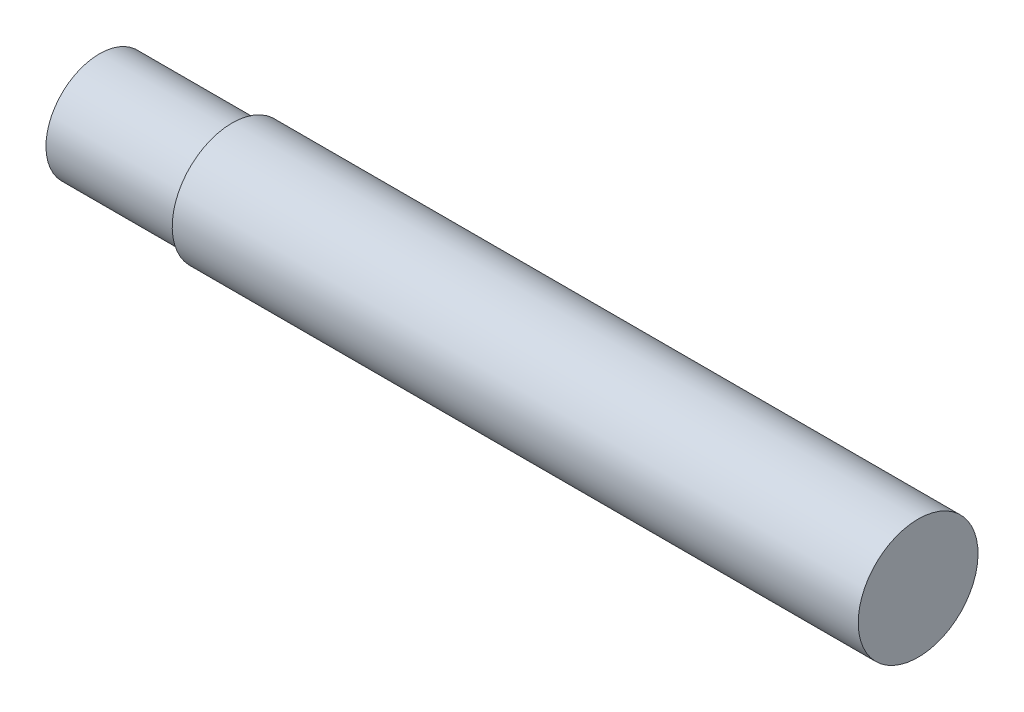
from build123d import *


with BuildPart() as part:
    # Sketch1 → Revolve1 (revolve)
    with BuildSketch(Plane.XY):
        Polygon((-574, 37.5), (-481, 37.5), (-481, 42), (0, 42), (0, 0), (-574, 0), align=None)
    revolve(axis=Axis((0, 0, 0), (-1, 0, 0)))


solid = part.part
